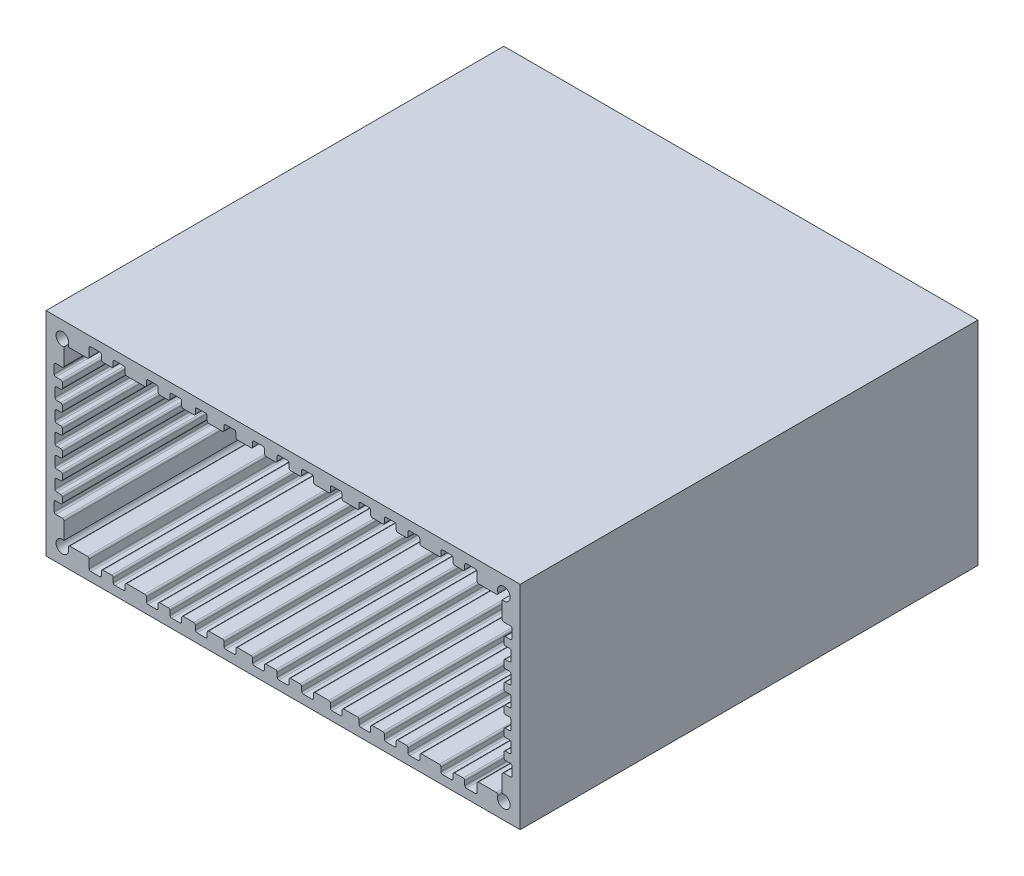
from build123d import *

# Parameters (mm, degrees)
SKETCH1_W           = 73.66
SKETCH1_H           = 33.02
BOSS_EXTRUDE1_DEPTH = 71.12


with BuildPart() as part:
    # Sketch1 → Boss-Extrude1 (new body)
    with BuildSketch(Plane(origin=(0, 0, 0), x_dir=(-1, 0, 0), z_dir=(0, 0, -1))):
        with Locations((-112.35, 73.38)):
            Rectangle(SKETCH1_W, SKETCH1_H)
        with BuildLine():
            Line((-145.468498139, 86.715), (-142.7284, 86.715))
            ThreePointArc((-142.7284, 86.715), (-142.548794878, 86.789394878), (-142.4744, 86.969))
            Line((-142.4744, 86.969), (-142.4744, 88.239))
            ThreePointArc((-142.4744, 88.239), (-142.400005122, 88.418605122), (-142.2204, 88.493))
            Line((-142.2204, 88.493), (-140.8234, 88.493))
            ThreePointArc((-140.8234, 88.493), (-140.643794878, 88.418605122), (-140.5694, 88.239))
            Line((-140.5694, 88.239), (-140.5694, 87.604))
            ThreePointArc((-140.5694, 87.604), (-140.495005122, 87.424394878), (-140.3154, 87.35))
            Line((-140.3154, 87.35), (-138.9946, 87.35))
            ThreePointArc((-138.9946, 87.35), (-138.814994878, 87.424394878), (-138.7406, 87.604))
            Line((-138.7406, 87.604), (-138.7406, 88.239))
            ThreePointArc((-138.7406, 88.239), (-138.666205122, 88.418605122), (-138.4866, 88.493))
            Line((-138.4866, 88.493), (-137.1404, 88.493))
            ThreePointArc((-137.1404, 88.493), (-136.960794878, 88.418605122), (-136.8864, 88.239))
            Line((-136.8864, 88.239), (-136.8864, 87.604))
            ThreePointArc((-136.8864, 87.604), (-136.812005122, 87.424394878), (-136.6324, 87.35))
            Line((-136.6324, 87.35), (-133.8384, 87.35))
            ThreePointArc((-133.8384, 87.35), (-133.658794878, 87.424394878), (-133.5844, 87.604))
            Line((-133.5844, 87.604), (-133.5844, 88.239))
            ThreePointArc((-133.5844, 88.239), (-133.510005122, 88.418605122), (-133.3304, 88.493))
            Line((-133.3304, 88.493), (-132.0096, 88.493))
            ThreePointArc((-132.0096, 88.493), (-131.829994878, 88.418605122), (-131.7556, 88.239))
            Line((-131.7556, 88.239), (-131.7556, 87.604))
            ThreePointArc((-131.7556, 87.604), (-131.681205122, 87.424394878), (-131.5016, 87.35))
            Line((-131.5016, 87.35), (-130.1808, 87.35))
            ThreePointArc((-130.1808, 87.35), (-130.001194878, 87.424394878), (-129.9268, 87.604))
            Line((-129.9268, 87.604), (-129.9268, 88.239))
            ThreePointArc((-129.9268, 88.239), (-129.852405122, 88.418605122), (-129.6728, 88.493))
            Line((-129.6728, 88.493), (-128.352, 88.493))
            ThreePointArc((-128.352, 88.493), (-128.172394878, 88.418605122), (-128.098, 88.239))
            Line((-128.098, 88.239), (-128.098, 87.604))
            ThreePointArc((-128.098, 87.604), (-128.023605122, 87.424394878), (-127.844, 87.35))
            Line((-127.844, 87.35), (-126.2184, 87.35))
            ThreePointArc((-126.2184, 87.35), (-126.038794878, 87.424394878), (-125.9644, 87.604))
            Line((-125.9644, 87.604), (-125.9644, 88.239))
            ThreePointArc((-125.9644, 88.239), (-125.890005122, 88.418605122), (-125.7104, 88.493))
            Line((-125.7104, 88.493), (-124.3896, 88.493))
            ThreePointArc((-124.3896, 88.493), (-124.209994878, 88.418605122), (-124.1356, 88.239))
            Line((-124.1356, 88.239), (-124.1356, 87.604))
            ThreePointArc((-124.1356, 87.604), (-124.061205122, 87.424394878), (-123.8816, 87.35))
            Line((-123.8816, 87.35), (-121.7734, 87.35))
            ThreePointArc((-121.7734, 87.35), (-121.593794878, 87.424394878), (-121.5194, 87.604))
            Line((-121.5194, 87.604), (-121.5194, 88.239))
            ThreePointArc((-121.5194, 88.239), (-121.445005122, 88.418605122), (-121.2654, 88.493))
            Line((-121.2654, 88.493), (-119.9446, 88.493))
            ThreePointArc((-119.9446, 88.493), (-119.764994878, 88.418605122), (-119.6906, 88.239))
            Line((-119.6906, 88.239), (-119.6906, 87.604))
            ThreePointArc((-119.6906, 87.604), (-119.616205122, 87.424394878), (-119.4366, 87.35))
            Line((-119.4366, 87.35), (-117.3284, 87.35))
            ThreePointArc((-117.3284, 87.35), (-117.148794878, 87.424394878), (-117.0744, 87.604))
            Line((-117.0744, 87.604), (-117.0744, 88.239))
            ThreePointArc((-117.0744, 88.239), (-117.000005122, 88.418605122), (-116.8204, 88.493))
            Line((-116.8204, 88.493), (-115.4996, 88.493))
            ThreePointArc((-115.4996, 88.493), (-115.319994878, 88.418605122), (-115.2456, 88.239))
            Line((-115.2456, 88.239), (-115.2456, 87.604))
            ThreePointArc((-115.2456, 87.604), (-115.171205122, 87.424394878), (-114.9916, 87.35))
            Line((-114.9916, 87.35), (-113.5184, 87.35))
            ThreePointArc((-113.5184, 87.35), (-113.338794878, 87.424394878), (-113.2644, 87.604))
            Line((-113.2644, 87.604), (-113.2644, 88.239))
            ThreePointArc((-113.2644, 88.239), (-113.190005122, 88.418605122), (-113.0104, 88.493))
            Line((-113.0104, 88.493), (-111.6896, 88.493))
            ThreePointArc((-111.6896, 88.493), (-111.509994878, 88.418605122), (-111.4356, 88.239))
            Line((-111.4356, 88.239), (-111.4356, 87.604))
            ThreePointArc((-111.4356, 87.604), (-111.361205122, 87.424394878), (-111.1816, 87.35))
            Line((-111.1816, 87.35), (-109.7084, 87.35))
            ThreePointArc((-109.7084, 87.35), (-109.528794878, 87.424394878), (-109.4544, 87.604))
            Line((-109.4544, 87.604), (-109.4544, 88.239))
            ThreePointArc((-109.4544, 88.239), (-109.380005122, 88.418605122), (-109.2004, 88.493))
            Line((-109.2004, 88.493), (-107.8796, 88.493))
            ThreePointArc((-107.8796, 88.493), (-107.699994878, 88.418605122), (-107.6256, 88.239))
            Line((-107.6256, 88.239), (-107.6256, 87.604))
            ThreePointArc((-107.6256, 87.604), (-107.551205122, 87.424394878), (-107.3716, 87.35))
            Line((-107.3716, 87.35), (-105.2634, 87.35))
            ThreePointArc((-105.2634, 87.35), (-105.083794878, 87.424394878), (-105.0094, 87.604))
            Line((-105.0094, 87.604), (-105.0094, 88.239))
            ThreePointArc((-105.0094, 88.239), (-104.935005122, 88.418605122), (-104.7554, 88.493))
            Line((-104.7554, 88.493), (-103.4346, 88.493))
            ThreePointArc((-103.4346, 88.493), (-103.254994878, 88.418605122), (-103.1806, 88.239))
            Line((-103.1806, 88.239), (-103.1806, 87.604))
            ThreePointArc((-103.1806, 87.604), (-103.106205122, 87.424394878), (-102.9266, 87.35))
            Line((-102.9266, 87.35), (-100.8184, 87.35))
            ThreePointArc((-100.8184, 87.35), (-100.638794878, 87.424394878), (-100.5644, 87.604))
            Line((-100.5644, 87.604), (-100.5644, 88.239))
            ThreePointArc((-100.5644, 88.239), (-100.490005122, 88.418605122), (-100.3104, 88.493))
            Line((-100.3104, 88.493), (-98.9896, 88.493))
            ThreePointArc((-98.9896, 88.493), (-98.809994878, 88.418605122), (-98.7356, 88.239))
            Line((-98.7356, 88.239), (-98.7356, 87.604))
            ThreePointArc((-98.7356, 87.604), (-98.661205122, 87.424394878), (-98.4816, 87.35))
            Line((-98.4816, 87.35), (-96.856, 87.35))
            ThreePointArc((-96.856, 87.35), (-96.676394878, 87.424394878), (-96.602, 87.604))
            Line((-96.602, 87.604), (-96.602, 88.239))
            ThreePointArc((-96.602, 88.239), (-96.527605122, 88.418605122), (-96.348, 88.493))
            Line((-96.348, 88.493), (-95.0272, 88.493))
            ThreePointArc((-95.0272, 88.493), (-94.847594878, 88.418605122), (-94.7732, 88.239))
            Line((-94.7732, 88.239), (-94.7732, 87.604))
            ThreePointArc((-94.7732, 87.604), (-94.698805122, 87.424394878), (-94.5192, 87.35))
            Line((-94.5192, 87.35), (-93.1984, 87.35))
            ThreePointArc((-93.1984, 87.35), (-93.018794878, 87.424394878), (-92.9444, 87.604))
            Line((-92.9444, 87.604), (-92.9444, 88.239))
            ThreePointArc((-92.9444, 88.239), (-92.870005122, 88.418605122), (-92.6904, 88.493))
            Line((-92.6904, 88.493), (-91.3696, 88.493))
            ThreePointArc((-91.3696, 88.493), (-91.189994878, 88.418605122), (-91.1156, 88.239))
            Line((-91.1156, 88.239), (-91.1156, 87.604))
            ThreePointArc((-91.1156, 87.604), (-91.041205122, 87.424394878), (-90.8616, 87.35))
            Line((-90.8616, 87.35), (-88.0676, 87.35))
            ThreePointArc((-88.0676, 87.35), (-87.887994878, 87.424394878), (-87.8136, 87.604))
            Line((-87.8136, 87.604), (-87.8136, 88.239))
            ThreePointArc((-87.8136, 88.239), (-87.739205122, 88.418605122), (-87.5596, 88.493))
            Line((-87.5596, 88.493), (-86.2134, 88.493))
            ThreePointArc((-86.2134, 88.493), (-86.033794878, 88.418605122), (-85.9594, 88.239))
            Line((-85.9594, 88.239), (-85.9594, 87.604))
            ThreePointArc((-85.9594, 87.604), (-85.885005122, 87.424394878), (-85.7054, 87.35))
            Line((-85.7054, 87.35), (-84.3846, 87.35))
            ThreePointArc((-84.3846, 87.35), (-84.204994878, 87.424394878), (-84.1306, 87.604))
            Line((-84.1306, 87.604), (-84.1306, 88.239))
            ThreePointArc((-84.1306, 88.239), (-84.056205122, 88.418605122), (-83.8766, 88.493))
            Line((-83.8766, 88.493), (-82.4796, 88.493))
            ThreePointArc((-82.4796, 88.493), (-82.299994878, 88.418605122), (-82.2256, 88.239))
            Line((-82.2256, 88.239), (-82.2256, 86.969))
            ThreePointArc((-82.2256, 86.969), (-82.151205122, 86.789394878), (-81.9716, 86.715))
            Line((-81.9716, 86.715), (-79.231501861, 86.715))
            ThreePointArc((-79.231501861, 86.715), (-79.025991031, 86.819730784), (-78.989955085, 87.047556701))
            ThreePointArc((-78.989955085, 87.047556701), (-77.386617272, 88.05911502), (-78.314, 86.405662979))
            Line((-78.314, 86.405662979), (-78.314, 83.794))
            ThreePointArc((-78.314, 83.794), (-78.239605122, 83.614394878), (-78.06, 83.54))
            Line((-78.06, 83.54), (-77.044, 83.54))
            ThreePointArc((-77.044, 83.54), (-76.864394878, 83.465605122), (-76.79, 83.286))
            Line((-76.79, 83.286), (-76.79, 81.9652))
            ThreePointArc((-76.79, 81.9652), (-76.864394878, 81.785594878), (-77.044, 81.7112))
            Line((-77.044, 81.7112), (-77.806, 81.7112))
            ThreePointArc((-77.806, 81.7112), (-77.985605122, 81.636805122), (-78.06, 81.4572))
            Line((-78.06, 81.4572), (-78.06, 80.71044))
            ThreePointArc((-78.06, 80.71044), (-77.985605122, 80.530834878), (-77.806, 80.45644))
            Line((-77.806, 80.45644), (-77.171, 80.45644))
            ThreePointArc((-77.171, 80.45644), (-76.991394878, 80.382045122), (-76.917, 80.20244))
            Line((-76.917, 80.20244), (-76.917, 78.88164))
            ThreePointArc((-76.917, 78.88164), (-76.991394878, 78.702034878), (-77.171, 78.62764))
            Line((-77.171, 78.62764), (-77.806, 78.62764))
            ThreePointArc((-77.806, 78.62764), (-77.985605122, 78.553245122), (-78.06, 78.37364))
            Line((-78.06, 78.37364), (-78.06, 77.62942))
            ThreePointArc((-78.06, 77.62942), (-77.985605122, 77.449814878), (-77.806, 77.37542))
            Line((-77.806, 77.37542), (-77.171, 77.37542))
            ThreePointArc((-77.171, 77.37542), (-76.991394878, 77.301025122), (-76.917, 77.12142))
            Line((-76.917, 77.12142), (-76.917, 75.80062))
            ThreePointArc((-76.917, 75.80062), (-76.991394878, 75.621014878), (-77.171, 75.54662))
            Line((-77.171, 75.54662), (-77.806, 75.54662))
            ThreePointArc((-77.806, 75.54662), (-77.985605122, 75.472225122), (-78.06, 75.29262))
            Line((-78.06, 75.29262), (-78.06, 74.5484))
            ThreePointArc((-78.06, 74.5484), (-77.985605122, 74.368794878), (-77.806, 74.2944))
            Line((-77.806, 74.2944), (-77.171, 74.2944))
            ThreePointArc((-77.171, 74.2944), (-76.991394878, 74.220005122), (-76.917, 74.0404))
            Line((-76.917, 74.0404), (-76.917, 72.7196))
            ThreePointArc((-76.917, 72.7196), (-76.991394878, 72.539994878), (-77.171, 72.4656))
            Line((-77.171, 72.4656), (-77.806, 72.4656))
            ThreePointArc((-77.806, 72.4656), (-77.985605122, 72.391205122), (-78.06, 72.2116))
            Line((-78.06, 72.2116), (-78.06, 71.46738))
            ThreePointArc((-78.06, 71.46738), (-77.985605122, 71.287774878), (-77.806, 71.21338))
            Line((-77.806, 71.21338), (-77.171, 71.21338))
            ThreePointArc((-77.171, 71.21338), (-76.991394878, 71.138985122), (-76.917, 70.95938))
            Line((-76.917, 70.95938), (-76.917, 69.63858))
            ThreePointArc((-76.917, 69.63858), (-76.991394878, 69.458974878), (-77.171, 69.38458))
            Line((-77.171, 69.38458), (-77.806, 69.38458))
            ThreePointArc((-77.806, 69.38458), (-77.985605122, 69.310185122), (-78.06, 69.13058))
            Line((-78.06, 69.13058), (-78.06, 68.38636))
            ThreePointArc((-78.06, 68.38636), (-77.985605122, 68.206754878), (-77.806, 68.13236))
            Line((-77.806, 68.13236), (-77.171, 68.13236))
            ThreePointArc((-77.171, 68.13236), (-76.991394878, 68.057965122), (-76.917, 67.87836))
            Line((-76.917, 67.87836), (-76.917, 66.55756))
            ThreePointArc((-76.917, 66.55756), (-76.991394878, 66.377954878), (-77.171, 66.30356))
            Line((-77.171, 66.30356), (-77.806, 66.30356))
            ThreePointArc((-77.806, 66.30356), (-77.985605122, 66.229165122), (-78.06, 66.04956))
            Line((-78.06, 66.04956), (-78.06, 65.3028))
            ThreePointArc((-78.06, 65.3028), (-77.985605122, 65.123194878), (-77.806, 65.0488))
            Line((-77.806, 65.0488), (-77.044, 65.0488))
            ThreePointArc((-77.044, 65.0488), (-76.864394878, 64.974405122), (-76.79, 64.7948))
            Line((-76.79, 64.7948), (-76.79, 63.474))
            ThreePointArc((-76.79, 63.474), (-76.864394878, 63.294394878), (-77.044, 63.22))
            Line((-77.044, 63.22), (-78.06, 63.22))
            ThreePointArc((-78.06, 63.22), (-78.239605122, 63.145605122), (-78.314, 62.966))
            Line((-78.314, 62.966), (-78.314, 60.354337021))
            ThreePointArc((-78.314, 60.354337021), (-77.386617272, 58.70088498), (-78.989955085, 59.712443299))
            ThreePointArc((-78.989955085, 59.712443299), (-79.025991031, 59.940269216), (-79.231501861, 60.045))
            Line((-79.231501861, 60.045), (-81.9716, 60.045))
            ThreePointArc((-81.9716, 60.045), (-82.151205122, 59.970605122), (-82.2256, 59.791))
            Line((-82.2256, 59.791), (-82.2256, 58.521))
            ThreePointArc((-82.2256, 58.521), (-82.299994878, 58.341394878), (-82.4796, 58.267))
            Line((-82.4796, 58.267), (-83.8766, 58.267))
            ThreePointArc((-83.8766, 58.267), (-84.056205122, 58.341394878), (-84.1306, 58.521))
            Line((-84.1306, 58.521), (-84.1306, 59.156))
            ThreePointArc((-84.1306, 59.156), (-84.204994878, 59.335605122), (-84.3846, 59.41))
            Line((-84.3846, 59.41), (-85.7054, 59.41))
            ThreePointArc((-85.7054, 59.41), (-85.885005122, 59.335605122), (-85.9594, 59.156))
            Line((-85.9594, 59.156), (-85.9594, 58.521))
            ThreePointArc((-85.9594, 58.521), (-86.033794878, 58.341394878), (-86.2134, 58.267))
            Line((-86.2134, 58.267), (-87.5596, 58.267))
            ThreePointArc((-87.5596, 58.267), (-87.739205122, 58.341394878), (-87.8136, 58.521))
            Line((-87.8136, 58.521), (-87.8136, 59.156))
            ThreePointArc((-87.8136, 59.156), (-87.887994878, 59.335605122), (-88.0676, 59.41))
            Line((-88.0676, 59.41), (-90.8616, 59.41))
            ThreePointArc((-90.8616, 59.41), (-91.041205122, 59.335605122), (-91.1156, 59.156))
            Line((-91.1156, 59.156), (-91.1156, 58.521))
            ThreePointArc((-91.1156, 58.521), (-91.189994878, 58.341394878), (-91.3696, 58.267))
            Line((-91.3696, 58.267), (-92.6904, 58.267))
            ThreePointArc((-92.6904, 58.267), (-92.870005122, 58.341394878), (-92.9444, 58.521))
            Line((-92.9444, 58.521), (-92.9444, 59.156))
            ThreePointArc((-92.9444, 59.156), (-93.018794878, 59.335605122), (-93.1984, 59.41))
            Line((-93.1984, 59.41), (-94.5192, 59.41))
            ThreePointArc((-94.5192, 59.41), (-94.698805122, 59.335605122), (-94.7732, 59.156))
            Line((-94.7732, 59.156), (-94.7732, 58.521))
            ThreePointArc((-94.7732, 58.521), (-94.847594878, 58.341394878), (-95.0272, 58.267))
            Line((-95.0272, 58.267), (-96.348, 58.267))
            ThreePointArc((-96.348, 58.267), (-96.527605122, 58.341394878), (-96.602, 58.521))
            Line((-96.602, 58.521), (-96.602, 59.156))
            ThreePointArc((-96.602, 59.156), (-96.676394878, 59.335605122), (-96.856, 59.41))
            Line((-96.856, 59.41), (-98.4816, 59.41))
            ThreePointArc((-98.4816, 59.41), (-98.661205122, 59.335605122), (-98.7356, 59.156))
            Line((-98.7356, 59.156), (-98.7356, 58.521))
            ThreePointArc((-98.7356, 58.521), (-98.809994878, 58.341394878), (-98.9896, 58.267))
            Line((-98.9896, 58.267), (-100.3104, 58.267))
            ThreePointArc((-100.3104, 58.267), (-100.490005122, 58.341394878), (-100.5644, 58.521))
            Line((-100.5644, 58.521), (-100.5644, 59.156))
            ThreePointArc((-100.5644, 59.156), (-100.638794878, 59.335605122), (-100.8184, 59.41))
            Line((-100.8184, 59.41), (-102.9266, 59.41))
            ThreePointArc((-102.9266, 59.41), (-103.106205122, 59.335605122), (-103.1806, 59.156))
            Line((-103.1806, 59.156), (-103.1806, 58.521))
            ThreePointArc((-103.1806, 58.521), (-103.254994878, 58.341394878), (-103.4346, 58.267))
            Line((-103.4346, 58.267), (-104.7554, 58.267))
            ThreePointArc((-104.7554, 58.267), (-104.935005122, 58.341394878), (-105.0094, 58.521))
            Line((-105.0094, 58.521), (-105.0094, 59.156))
            ThreePointArc((-105.0094, 59.156), (-105.083794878, 59.335605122), (-105.2634, 59.41))
            Line((-105.2634, 59.41), (-107.3716, 59.41))
            ThreePointArc((-107.3716, 59.41), (-107.551205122, 59.335605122), (-107.6256, 59.156))
            Line((-107.6256, 59.156), (-107.6256, 58.521))
            ThreePointArc((-107.6256, 58.521), (-107.699994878, 58.341394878), (-107.8796, 58.267))
            Line((-107.8796, 58.267), (-109.2004, 58.267))
            ThreePointArc((-109.2004, 58.267), (-109.380005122, 58.341394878), (-109.4544, 58.521))
            Line((-109.4544, 58.521), (-109.4544, 59.156))
            ThreePointArc((-109.4544, 59.156), (-109.528794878, 59.335605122), (-109.7084, 59.41))
            Line((-109.7084, 59.41), (-111.1816, 59.41))
            ThreePointArc((-111.1816, 59.41), (-111.361205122, 59.335605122), (-111.4356, 59.156))
            Line((-111.4356, 59.156), (-111.4356, 58.521))
            ThreePointArc((-111.4356, 58.521), (-111.509994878, 58.341394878), (-111.6896, 58.267))
            Line((-111.6896, 58.267), (-113.0104, 58.267))
            ThreePointArc((-113.0104, 58.267), (-113.190005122, 58.341394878), (-113.2644, 58.521))
            Line((-113.2644, 58.521), (-113.2644, 59.156))
            ThreePointArc((-113.2644, 59.156), (-113.338794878, 59.335605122), (-113.5184, 59.41))
            Line((-113.5184, 59.41), (-114.9916, 59.41))
            ThreePointArc((-114.9916, 59.41), (-115.171205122, 59.335605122), (-115.2456, 59.156))
            Line((-115.2456, 59.156), (-115.2456, 58.521))
            ThreePointArc((-115.2456, 58.521), (-115.319994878, 58.341394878), (-115.4996, 58.267))
            Line((-115.4996, 58.267), (-116.8204, 58.267))
            ThreePointArc((-116.8204, 58.267), (-117.000005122, 58.341394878), (-117.0744, 58.521))
            Line((-117.0744, 58.521), (-117.0744, 59.156))
            ThreePointArc((-117.0744, 59.156), (-117.148794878, 59.335605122), (-117.3284, 59.41))
            Line((-117.3284, 59.41), (-119.4366, 59.41))
            ThreePointArc((-119.4366, 59.41), (-119.616205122, 59.335605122), (-119.6906, 59.156))
            Line((-119.6906, 59.156), (-119.6906, 58.521))
            ThreePointArc((-119.6906, 58.521), (-119.764994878, 58.341394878), (-119.9446, 58.267))
            Line((-119.9446, 58.267), (-121.2654, 58.267))
            ThreePointArc((-121.2654, 58.267), (-121.445005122, 58.341394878), (-121.5194, 58.521))
            Line((-121.5194, 58.521), (-121.5194, 59.156))
            ThreePointArc((-121.5194, 59.156), (-121.593794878, 59.335605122), (-121.7734, 59.41))
            Line((-121.7734, 59.41), (-123.8816, 59.41))
            ThreePointArc((-123.8816, 59.41), (-124.061205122, 59.335605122), (-124.1356, 59.156))
            Line((-124.1356, 59.156), (-124.1356, 58.521))
            ThreePointArc((-124.1356, 58.521), (-124.209994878, 58.341394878), (-124.3896, 58.267))
            Line((-124.3896, 58.267), (-125.7104, 58.267))
            ThreePointArc((-125.7104, 58.267), (-125.890005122, 58.341394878), (-125.9644, 58.521))
            Line((-125.9644, 58.521), (-125.9644, 59.156))
            ThreePointArc((-125.9644, 59.156), (-126.038794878, 59.335605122), (-126.2184, 59.41))
            Line((-126.2184, 59.41), (-127.844, 59.41))
            ThreePointArc((-127.844, 59.41), (-128.023605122, 59.335605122), (-128.098, 59.156))
            Line((-128.098, 59.156), (-128.098, 58.521))
            ThreePointArc((-128.098, 58.521), (-128.172394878, 58.341394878), (-128.352, 58.267))
            Line((-128.352, 58.267), (-129.6728, 58.267))
            ThreePointArc((-129.6728, 58.267), (-129.852405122, 58.341394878), (-129.9268, 58.521))
            Line((-129.9268, 58.521), (-129.9268, 59.156))
            ThreePointArc((-129.9268, 59.156), (-130.001194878, 59.335605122), (-130.1808, 59.41))
            Line((-130.1808, 59.41), (-131.5016, 59.41))
            ThreePointArc((-131.5016, 59.41), (-131.681205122, 59.335605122), (-131.7556, 59.156))
            Line((-131.7556, 59.156), (-131.7556, 58.521))
            ThreePointArc((-131.7556, 58.521), (-131.829994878, 58.341394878), (-132.0096, 58.267))
            Line((-132.0096, 58.267), (-133.3304, 58.267))
            ThreePointArc((-133.3304, 58.267), (-133.510005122, 58.341394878), (-133.5844, 58.521))
            Line((-133.5844, 58.521), (-133.5844, 59.156))
            ThreePointArc((-133.5844, 59.156), (-133.658794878, 59.335605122), (-133.8384, 59.41))
            Line((-133.8384, 59.41), (-136.6324, 59.41))
            ThreePointArc((-136.6324, 59.41), (-136.812005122, 59.335605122), (-136.8864, 59.156))
            Line((-136.8864, 59.156), (-136.8864, 58.521))
            ThreePointArc((-136.8864, 58.521), (-136.960794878, 58.341394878), (-137.1404, 58.267))
            Line((-137.1404, 58.267), (-138.4866, 58.267))
            ThreePointArc((-138.4866, 58.267), (-138.666205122, 58.341394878), (-138.7406, 58.521))
            Line((-138.7406, 58.521), (-138.7406, 59.156))
            ThreePointArc((-138.7406, 59.156), (-138.814994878, 59.335605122), (-138.9946, 59.41))
            Line((-138.9946, 59.41), (-140.3154, 59.41))
            ThreePointArc((-140.3154, 59.41), (-140.495005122, 59.335605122), (-140.5694, 59.156))
            Line((-140.5694, 59.156), (-140.5694, 58.521))
            ThreePointArc((-140.5694, 58.521), (-140.643794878, 58.341394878), (-140.8234, 58.267))
            Line((-140.8234, 58.267), (-142.2204, 58.267))
            ThreePointArc((-142.2204, 58.267), (-142.400005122, 58.341394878), (-142.4744, 58.521))
            Line((-142.4744, 58.521), (-142.4744, 59.791))
            ThreePointArc((-142.4744, 59.791), (-142.548794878, 59.970605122), (-142.7284, 60.045))
            Line((-142.7284, 60.045), (-145.468498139, 60.045))
            ThreePointArc((-145.468498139, 60.045), (-145.674008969, 59.940269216), (-145.710044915, 59.712443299))
            ThreePointArc((-145.710044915, 59.712443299), (-147.313382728, 58.70088498), (-146.386, 60.354337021))
            Line((-146.386, 60.354337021), (-146.386, 62.966))
            ThreePointArc((-146.386, 62.966), (-146.460394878, 63.145605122), (-146.64, 63.22))
            Line((-146.64, 63.22), (-147.656, 63.22))
            ThreePointArc((-147.656, 63.22), (-147.835605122, 63.294394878), (-147.91, 63.474))
            Line((-147.91, 63.474), (-147.91, 64.7948))
            ThreePointArc((-147.91, 64.7948), (-147.835605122, 64.974405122), (-147.656, 65.0488))
            Line((-147.656, 65.0488), (-146.894, 65.0488))
            ThreePointArc((-146.894, 65.0488), (-146.714394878, 65.123194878), (-146.64, 65.3028))
            Line((-146.64, 65.3028), (-146.64, 66.04956))
            ThreePointArc((-146.64, 66.04956), (-146.714394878, 66.229165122), (-146.894, 66.30356))
            Line((-146.894, 66.30356), (-147.529, 66.30356))
            ThreePointArc((-147.529, 66.30356), (-147.708605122, 66.377954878), (-147.783, 66.55756))
            Line((-147.783, 66.55756), (-147.783, 67.87836))
            ThreePointArc((-147.783, 67.87836), (-147.708605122, 68.057965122), (-147.529, 68.13236))
            Line((-147.529, 68.13236), (-146.894, 68.13236))
            ThreePointArc((-146.894, 68.13236), (-146.714394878, 68.206754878), (-146.64, 68.38636))
            Line((-146.64, 68.38636), (-146.64, 69.13058))
            ThreePointArc((-146.64, 69.13058), (-146.714394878, 69.310185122), (-146.894, 69.38458))
            Line((-146.894, 69.38458), (-147.529, 69.38458))
            ThreePointArc((-147.529, 69.38458), (-147.708605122, 69.458974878), (-147.783, 69.63858))
            Line((-147.783, 69.63858), (-147.783, 70.95938))
            ThreePointArc((-147.783, 70.95938), (-147.708605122, 71.138985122), (-147.529, 71.21338))
            Line((-147.529, 71.21338), (-146.894, 71.21338))
            ThreePointArc((-146.894, 71.21338), (-146.714394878, 71.287774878), (-146.64, 71.46738))
            Line((-146.64, 71.46738), (-146.64, 72.2116))
            ThreePointArc((-146.64, 72.2116), (-146.714394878, 72.391205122), (-146.894, 72.4656))
            Line((-146.894, 72.4656), (-147.529, 72.4656))
            ThreePointArc((-147.529, 72.4656), (-147.708605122, 72.539994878), (-147.783, 72.7196))
            Line((-147.783, 72.7196), (-147.783, 74.0404))
            ThreePointArc((-147.783, 74.0404), (-147.708605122, 74.220005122), (-147.529, 74.2944))
            Line((-147.529, 74.2944), (-146.894, 74.2944))
            ThreePointArc((-146.894, 74.2944), (-146.714394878, 74.368794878), (-146.64, 74.5484))
            Line((-146.64, 74.5484), (-146.64, 75.29262))
            ThreePointArc((-146.64, 75.29262), (-146.714394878, 75.472225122), (-146.894, 75.54662))
            Line((-146.894, 75.54662), (-147.529, 75.54662))
            ThreePointArc((-147.529, 75.54662), (-147.708605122, 75.621014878), (-147.783, 75.80062))
            Line((-147.783, 75.80062), (-147.783, 77.12142))
            ThreePointArc((-147.783, 77.12142), (-147.708605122, 77.301025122), (-147.529, 77.37542))
            Line((-147.529, 77.37542), (-146.894, 77.37542))
            ThreePointArc((-146.894, 77.37542), (-146.714394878, 77.449814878), (-146.64, 77.62942))
            Line((-146.64, 77.62942), (-146.64, 78.37364))
            ThreePointArc((-146.64, 78.37364), (-146.714394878, 78.553245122), (-146.894, 78.62764))
            Line((-146.894, 78.62764), (-147.529, 78.62764))
            ThreePointArc((-147.529, 78.62764), (-147.708605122, 78.702034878), (-147.783, 78.88164))
            Line((-147.783, 78.88164), (-147.783, 80.20244))
            ThreePointArc((-147.783, 80.20244), (-147.708605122, 80.382045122), (-147.529, 80.45644))
            Line((-147.529, 80.45644), (-146.894, 80.45644))
            ThreePointArc((-146.894, 80.45644), (-146.714394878, 80.530834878), (-146.64, 80.71044))
            Line((-146.64, 80.71044), (-146.64, 81.4572))
            ThreePointArc((-146.64, 81.4572), (-146.714394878, 81.636805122), (-146.894, 81.7112))
            Line((-146.894, 81.7112), (-147.656, 81.7112))
            ThreePointArc((-147.656, 81.7112), (-147.835605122, 81.785594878), (-147.91, 81.9652))
            Line((-147.91, 81.9652), (-147.91, 83.286))
            ThreePointArc((-147.91, 83.286), (-147.835605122, 83.465605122), (-147.656, 83.54))
            Line((-147.656, 83.54), (-146.64, 83.54))
            ThreePointArc((-146.64, 83.54), (-146.460394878, 83.614394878), (-146.386, 83.794))
            Line((-146.386, 83.794), (-146.386, 86.405662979))
            ThreePointArc((-146.386, 86.405662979), (-147.313382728, 88.05911502), (-145.710044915, 87.047556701))
            ThreePointArc((-145.710044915, 87.047556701), (-145.674008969, 86.819730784), (-145.468498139, 86.715))
        make_face(mode=Mode.SUBTRACT)
    extrude(amount=-BOSS_EXTRUDE1_DEPTH)


solid = part.part
